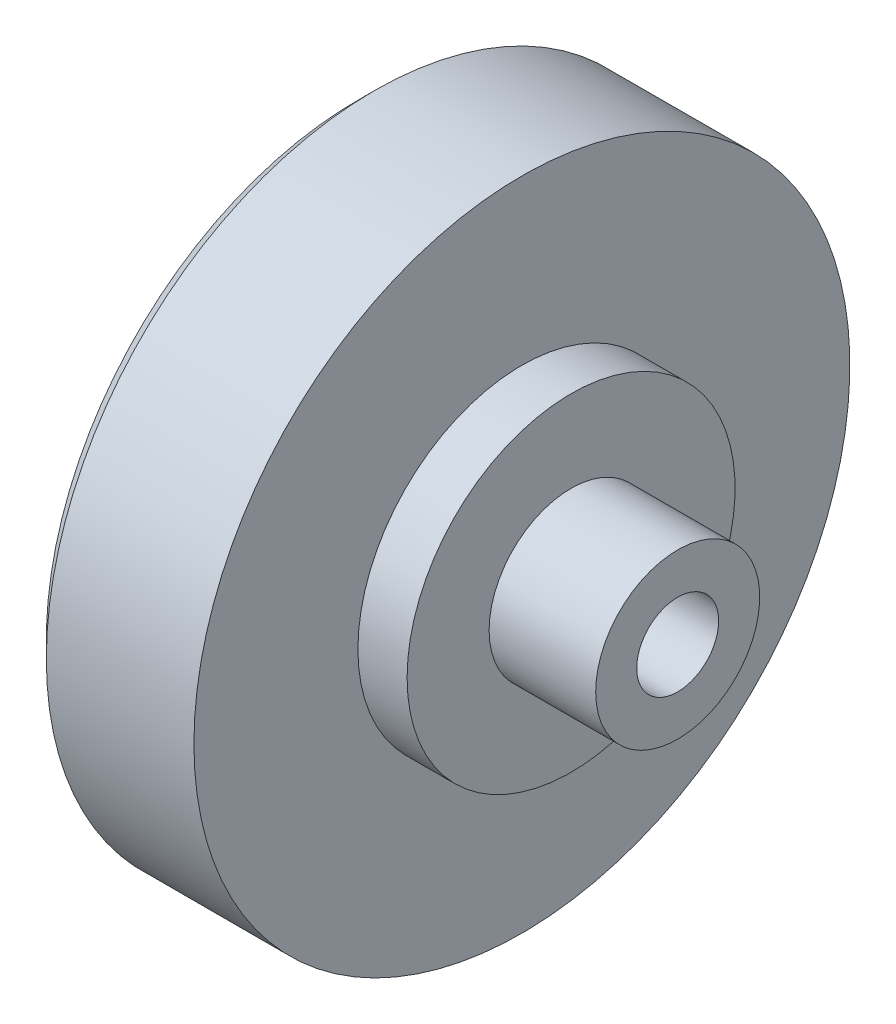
ISO-10303-21;
HEADER;
FILE_DESCRIPTION(('STEP AP214'),'2;1');
FILE_NAME('part.step','',(''),(''),'','','');
FILE_SCHEMA(('AUTOMOTIVE_DESIGN { 1 0 10303 214 1 1 1 1 }'));
ENDSEC;
DATA;
#1=APPLICATION_CONTEXT('core data for automotive mechanical design processes');
#2=APPLICATION_PROTOCOL_DEFINITION('international standard','automotive_design',2000,#1);
#3=PRODUCT_CONTEXT('',#1,'mechanical');
#4=PRODUCT('Part','Part','',(#3));
#5=PRODUCT_RELATED_PRODUCT_CATEGORY('part','',(#4));
#6=PRODUCT_DEFINITION_FORMATION('','',#4);
#7=PRODUCT_DEFINITION_CONTEXT('part definition',#1,'design');
#8=PRODUCT_DEFINITION('design','',#6,#7);
#9=PRODUCT_DEFINITION_SHAPE('','',#8);
#10=(LENGTH_UNIT() NAMED_UNIT(*) SI_UNIT(.MILLI.,.METRE.));
#11=(NAMED_UNIT(*) PLANE_ANGLE_UNIT() SI_UNIT($,.RADIAN.));
#12=(NAMED_UNIT(*) SI_UNIT($,.STERADIAN.) SOLID_ANGLE_UNIT());
#13=UNCERTAINTY_MEASURE_WITH_UNIT(LENGTH_MEASURE(1.E-05),#10,'distance_accuracy_value','');
#14=(GEOMETRIC_REPRESENTATION_CONTEXT(3) GLOBAL_UNCERTAINTY_ASSIGNED_CONTEXT((#13)) GLOBAL_UNIT_ASSIGNED_CONTEXT((#10,
#11,#12)) REPRESENTATION_CONTEXT('',''));
#15=CARTESIAN_POINT('',(0.,0.,0.));
#16=DIRECTION('',(0.,0.,1.));
#17=DIRECTION('',(1.,0.,0.));
#18=AXIS2_PLACEMENT_3D('',#15,#16,#17);
#19=CARTESIAN_POINT('',(0.,0.,-20.));
#20=DIRECTION('',(1.,0.,0.));
#21=DIRECTION('',(0.,0.,-1.));
#22=AXIS2_PLACEMENT_3D('',#19,#20,#21);
#23=PLANE('',#22);
#24=CARTESIAN_POINT('',(0.,0.,0.));
#25=DIRECTION('',(1.,0.,0.));
#26=DIRECTION('',(0.,0.,-1.));
#27=AXIS2_PLACEMENT_3D('',#24,#25,#26);
#28=CIRCLE('',#27,19.);
#29=CARTESIAN_POINT('',(0.,0.,-19.));
#30=VERTEX_POINT('',#29);
#31=EDGE_CURVE('E36',#30,#30,#28,.F.);
#32=ORIENTED_EDGE('',*,*,#31,.T.);
#33=EDGE_LOOP('',(#32));
#34=FACE_BOUND('',#33,.T.);
#35=ADVANCED_FACE('F30',(#34),#23,.F.);
#36=CARTESIAN_POINT('',(19.5,0.,0.));
#37=DIRECTION('',(-1.,0.,0.));
#38=DIRECTION('',(0.,0.,1.));
#39=AXIS2_PLACEMENT_3D('',#36,#37,#38);
#40=PLANE('',#39);
#41=CARTESIAN_POINT('',(19.5,0.,0.));
#42=DIRECTION('',(1.,0.,0.));
#43=DIRECTION('',(0.,0.,-1.));
#44=AXIS2_PLACEMENT_3D('',#41,#42,#43);
#45=CIRCLE('',#44,2.5);
#46=CARTESIAN_POINT('',(19.5,0.,-2.5));
#47=VERTEX_POINT('',#46);
#48=EDGE_CURVE('E61',#47,#47,#45,.T.);
#49=ORIENTED_EDGE('',*,*,#48,.F.);
#50=EDGE_LOOP('',(#49));
#51=FACE_BOUND('',#50,.T.);
#52=CARTESIAN_POINT('',(19.5,0.,0.));
#53=DIRECTION('',(-1.,0.,0.));
#54=DIRECTION('',(0.,0.,1.));
#55=AXIS2_PLACEMENT_3D('',#52,#53,#54);
#56=CIRCLE('',#55,5.);
#57=CARTESIAN_POINT('',(19.5,0.,5.));
#58=VERTEX_POINT('',#57);
#59=EDGE_CURVE('E40',#58,#58,#56,.T.);
#60=ORIENTED_EDGE('',*,*,#59,.F.);
#61=EDGE_LOOP('',(#60));
#62=FACE_BOUND('',#61,.T.);
#63=ADVANCED_FACE('F67',(#51,#62),#40,.F.);
#64=CARTESIAN_POINT('',(0.,0.,0.));
#65=DIRECTION('',(-1.,0.,0.));
#66=DIRECTION('',(0.,0.,1.));
#67=AXIS2_PLACEMENT_3D('',#64,#65,#66);
#68=CYLINDRICAL_SURFACE('',#67,5.);
#69=CARTESIAN_POINT('',(13.,0.,0.));
#70=DIRECTION('',(-1.,0.,0.));
#71=DIRECTION('',(0.,0.,1.));
#72=AXIS2_PLACEMENT_3D('',#69,#70,#71);
#73=CIRCLE('',#72,5.);
#74=CARTESIAN_POINT('',(13.,0.,5.));
#75=VERTEX_POINT('',#74);
#76=EDGE_CURVE('E44',#75,#75,#73,.T.);
#77=ORIENTED_EDGE('',*,*,#76,.F.);
#78=EDGE_LOOP('',(#77));
#79=FACE_BOUND('',#78,.T.);
#80=ORIENTED_EDGE('',*,*,#59,.T.);
#81=EDGE_LOOP('',(#80));
#82=FACE_BOUND('',#81,.T.);
#83=ADVANCED_FACE('F70',(#79,#82),#68,.T.);
#84=CARTESIAN_POINT('',(13.,0.,-5.));
#85=DIRECTION('',(-1.,0.,0.));
#86=DIRECTION('',(0.,0.,1.));
#87=AXIS2_PLACEMENT_3D('',#84,#85,#86);
#88=PLANE('',#87);
#89=CARTESIAN_POINT('',(13.,0.,0.));
#90=DIRECTION('',(-1.,0.,0.));
#91=DIRECTION('',(0.,0.,1.));
#92=AXIS2_PLACEMENT_3D('',#89,#90,#91);
#93=CIRCLE('',#92,9.99999999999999);
#94=CARTESIAN_POINT('',(13.,0.,9.99999999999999));
#95=VERTEX_POINT('',#94);
#96=EDGE_CURVE('E49',#95,#95,#93,.T.);
#97=ORIENTED_EDGE('',*,*,#96,.F.);
#98=EDGE_LOOP('',(#97));
#99=FACE_BOUND('',#98,.T.);
#100=ORIENTED_EDGE('',*,*,#76,.T.);
#101=EDGE_LOOP('',(#100));
#102=FACE_BOUND('',#101,.T.);
#103=ADVANCED_FACE('F74',(#99,#102),#88,.F.);
#104=CARTESIAN_POINT('',(0.,0.,0.));
#105=DIRECTION('',(-1.,0.,0.));
#106=DIRECTION('',(0.,0.,1.));
#107=AXIS2_PLACEMENT_3D('',#104,#105,#106);
#108=CYLINDRICAL_SURFACE('',#107,9.99999999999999);
#109=CARTESIAN_POINT('',(10.,0.,0.));
#110=DIRECTION('',(-1.,0.,0.));
#111=DIRECTION('',(0.,0.,1.));
#112=AXIS2_PLACEMENT_3D('',#109,#110,#111);
#113=CIRCLE('',#112,9.99999999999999);
#114=CARTESIAN_POINT('',(10.,0.,9.99999999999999));
#115=VERTEX_POINT('',#114);
#116=EDGE_CURVE('E52',#115,#115,#113,.T.);
#117=ORIENTED_EDGE('',*,*,#116,.F.);
#118=EDGE_LOOP('',(#117));
#119=FACE_BOUND('',#118,.T.);
#120=ORIENTED_EDGE('',*,*,#96,.T.);
#121=EDGE_LOOP('',(#120));
#122=FACE_BOUND('',#121,.T.);
#123=ADVANCED_FACE('F80',(#119,#122),#108,.T.);
#124=CARTESIAN_POINT('',(10.,0.,-9.99999999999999));
#125=DIRECTION('',(-1.,0.,0.));
#126=DIRECTION('',(0.,0.,1.));
#127=AXIS2_PLACEMENT_3D('',#124,#125,#126);
#128=PLANE('',#127);
#129=CARTESIAN_POINT('',(10.,0.,0.));
#130=DIRECTION('',(-1.,0.,0.));
#131=DIRECTION('',(0.,0.,1.));
#132=AXIS2_PLACEMENT_3D('',#129,#130,#131);
#133=CIRCLE('',#132,20.);
#134=CARTESIAN_POINT('',(10.,0.,20.));
#135=VERTEX_POINT('',#134);
#136=EDGE_CURVE('E55',#135,#135,#133,.T.);
#137=ORIENTED_EDGE('',*,*,#136,.F.);
#138=EDGE_LOOP('',(#137));
#139=FACE_BOUND('',#138,.T.);
#140=ORIENTED_EDGE('',*,*,#116,.T.);
#141=EDGE_LOOP('',(#140));
#142=FACE_BOUND('',#141,.T.);
#143=ADVANCED_FACE('F130',(#139,#142),#128,.F.);
#144=CARTESIAN_POINT('',(0.,0.,0.));
#145=DIRECTION('',(-1.,0.,0.));
#146=DIRECTION('',(0.,0.,1.));
#147=AXIS2_PLACEMENT_3D('',#144,#145,#146);
#148=CYLINDRICAL_SURFACE('',#147,20.);
#149=CARTESIAN_POINT('',(1.00000000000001,0.,0.));
#150=DIRECTION('',(1.,0.,0.));
#151=DIRECTION('',(0.,0.,-1.));
#152=AXIS2_PLACEMENT_3D('',#149,#150,#151);
#153=CIRCLE('',#152,20.);
#154=CARTESIAN_POINT('',(1.00000000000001,0.,-20.));
#155=VERTEX_POINT('',#154);
#156=EDGE_CURVE('E10',#155,#155,#153,.T.);
#157=ORIENTED_EDGE('',*,*,#156,.T.);
#158=EDGE_LOOP('',(#157));
#159=FACE_BOUND('',#158,.T.);
#160=ORIENTED_EDGE('',*,*,#136,.T.);
#161=EDGE_LOOP('',(#160));
#162=FACE_BOUND('',#161,.T.);
#163=ADVANCED_FACE('F125',(#159,#162),#148,.T.);
#164=CARTESIAN_POINT('',(0.,0.,0.));
#165=DIRECTION('',(1.,0.,0.));
#166=DIRECTION('',(0.,0.,-1.));
#167=AXIS2_PLACEMENT_3D('',#164,#165,#166);
#168=CONICAL_SURFACE('',#167,19.,0.785398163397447);
#169=ORIENTED_EDGE('',*,*,#156,.F.);
#170=EDGE_LOOP('',(#169));
#171=FACE_BOUND('',#170,.T.);
#172=ORIENTED_EDGE('',*,*,#31,.F.);
#173=EDGE_LOOP('',(#172));
#174=FACE_BOUND('',#173,.T.);
#175=ADVANCED_FACE('F100',(#171,#174),#168,.T.);
#176=CARTESIAN_POINT('',(4.5,0.,0.));
#177=DIRECTION('',(1.,0.,0.));
#178=DIRECTION('',(0.,0.,-1.));
#179=AXIS2_PLACEMENT_3D('',#176,#177,#178);
#180=CYLINDRICAL_SURFACE('',#179,2.5);
#181=CARTESIAN_POINT('',(4.5,0.,0.));
#182=DIRECTION('',(1.,0.,0.));
#183=DIRECTION('',(0.,0.,-1.));
#184=AXIS2_PLACEMENT_3D('',#181,#182,#183);
#185=CIRCLE('',#184,2.5);
#186=CARTESIAN_POINT('',(4.5,0.,-2.5));
#187=VERTEX_POINT('',#186);
#188=EDGE_CURVE('E58',#187,#187,#185,.T.);
#189=ORIENTED_EDGE('',*,*,#188,.F.);
#190=EDGE_LOOP('',(#189));
#191=FACE_BOUND('',#190,.T.);
#192=ORIENTED_EDGE('',*,*,#48,.T.);
#193=EDGE_LOOP('',(#192));
#194=FACE_BOUND('',#193,.T.);
#195=ADVANCED_FACE('F65',(#191,#194),#180,.F.);
#196=CARTESIAN_POINT('',(4.5,0.,0.));
#197=DIRECTION('',(1.,0.,0.));
#198=DIRECTION('',(0.,0.,-1.));
#199=AXIS2_PLACEMENT_3D('',#196,#197,#198);
#200=PLANE('',#199);
#201=ORIENTED_EDGE('',*,*,#188,.T.);
#202=EDGE_LOOP('',(#201));
#203=FACE_BOUND('',#202,.T.);
#204=ADVANCED_FACE('F109',(#203),#200,.T.);
#205=CLOSED_SHELL('',(#35,#63,#83,#103,#123,#143,#163,#175,#195,#204));
#206=MANIFOLD_SOLID_BREP('B2',#205);
#207=ADVANCED_BREP_SHAPE_REPRESENTATION('',(#18,#206),#14);
#208=SHAPE_DEFINITION_REPRESENTATION(#9,#207);
ENDSEC;
END-ISO-10303-21;
